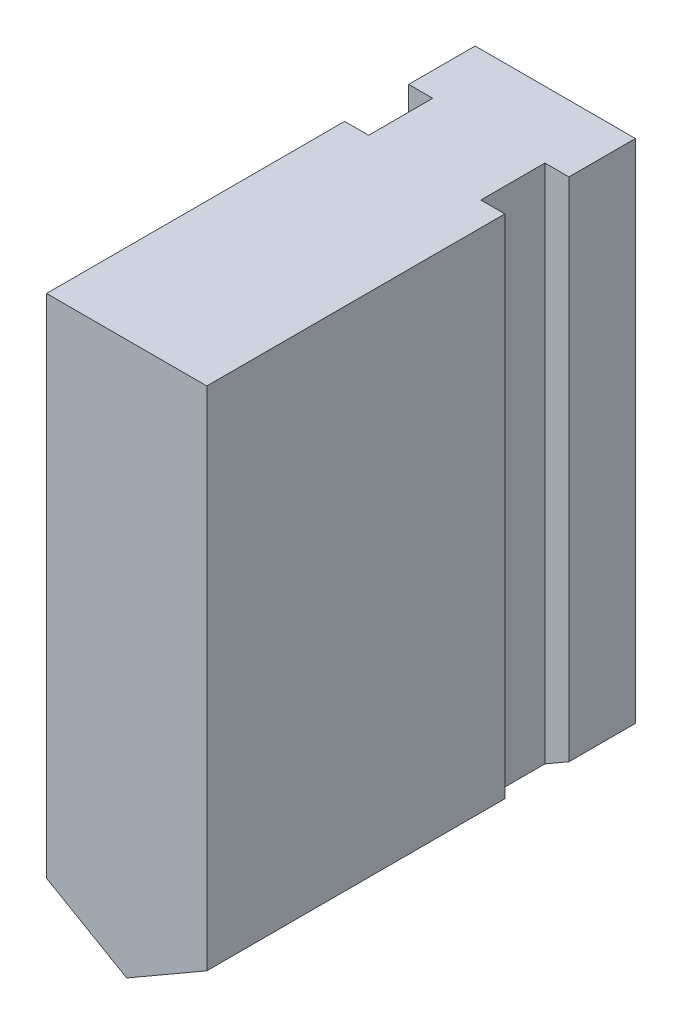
from build123d import *

# Parameters (mm, degrees)
BASE_EXTRUSION_DEPTH      = 32.5
BASE_EXTRUSION_DEPTH_BACK = 21
ESQUISSE2_W               = 10
ESQUISSE2_H               = 8
ENL_V_MAT_EXTRU_3_DEPTH   = 77.923663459


with BuildPart() as part:
    # Esquisse1 → Base-Extrusion (new, two sides: drawn at the far end of the back side and taken through both)
    with BuildSketch(Plane.XY.offset(-BASE_EXTRUSION_DEPTH_BACK)):
        Polygon((0, 0), (10, 5.773502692), (10, 69), (-10, 69), (-10, 5.773502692), align=None)
    extrude(amount=BASE_EXTRUSION_DEPTH + BASE_EXTRUSION_DEPTH_BACK)

    # Esquisse2 → Enl_v. mat.-Extru.3 (cut, through all)
    with BuildSketch(Plane(origin=(0, 0, 0), x_dir=(1, 0, 0), z_dir=(0, 1, 0))):
        with Locations((-12, 8.7)):
            Rectangle(ESQUISSE2_W, ESQUISSE2_H)
        with Locations((12, 8.7)):
            Rectangle(ESQUISSE2_W, ESQUISSE2_H)
    extrude(amount=ENL_V_MAT_EXTRU_3_DEPTH, mode=Mode.SUBTRACT)


solid = part.part
